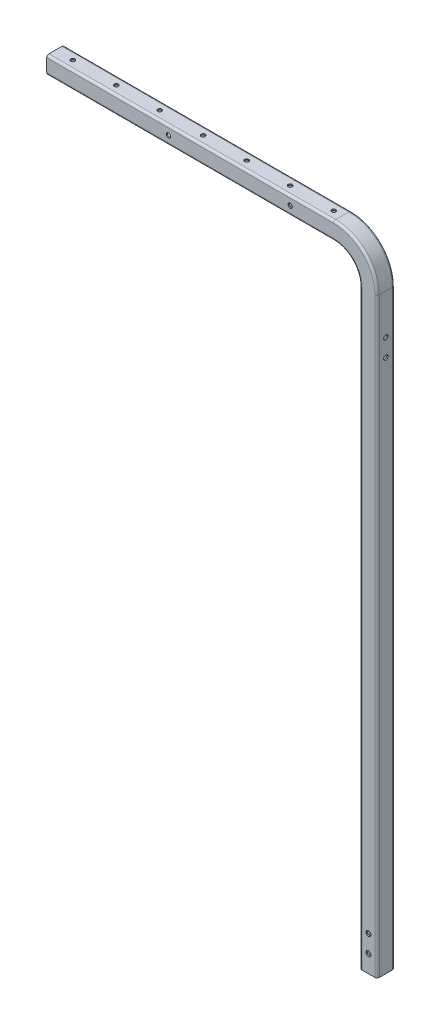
from build123d import *

# Parameters (mm, degrees)
SKETCH2_W                   = 25.4
SKETCH2_H                   = 25.4
FILLET1_R                   = 3.175
SHELL1_T                    = -1.5875
F_6_0_6_DIAMETER_HOLE1_D    = 6
LPATTERN3_COUNT             = 7
LPATTERN3_PITCH             = 63.5
SKETCH5_R                   = 3.175
CONT_MTG_DEPTH              = 1035.017122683
F_1_4_0_25_DIAMETER_HOLE1_D = 6.35
SKETCH8_R                   = 3.571875
CUT_EXTRUDE1_DEPTH          = 1035.251072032
LPATTERN2_COUNT             = 2
LPATTERN2_PITCH             = 25.4


with BuildPart() as part:
    # Base-Sweep: sweep along a path in Sketch1
    with BuildLine(Plane.XY) as base_sweep_path:
        Line((0, 0), (419.1, 0))
        ThreePointArc((419.1, 0), (455.021024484, -14.878975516), (469.9, -50.8))
        Line((469.9, -50.8), (469.9, -914.4))
    # Sketch2 (on Right Plane) → Base-Sweep (sweep)
    with BuildSketch(Plane(origin=(0, 0, 0), x_dir=(0, 0, -1), z_dir=(1, 0, 0))):
        Rectangle(SKETCH2_W, SKETCH2_H)
    sweep(path=base_sweep_path.line)

    # Fillet1
    fillet1_edges = [part.edges().sort_by_distance(p)[0] for p in [
        (464.001280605, -5.898719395, 12.7),
        (464.001280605, -5.898719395, -12.7),
        (446.040768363, -23.859231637, -12.7),
        (446.040768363, -23.859231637, 12.7),
        (482.6, -482.6, 12.7),
        (482.6, -482.6, -12.7),
        (457.2, -482.6, -12.7),
        (457.2, -482.6, 12.7),
        (209.55, 12.7, 12.7),
        (209.55, 12.7, -12.7),
        (209.55, -12.7, -12.7),
        (209.55, -12.7, 12.7),
    ]]
    fillet(fillet1_edges, radius=FILLET1_R)

    # Shell1
    shell1_openings = [part.faces().sort_by_distance(p)[0] for p in [
        (469.9, -914.4, 0),
        (0, 0, 0),
    ]]
    offset(amount=SHELL1_T, openings=shell1_openings, kind=Kind.INTERSECTION)

    # 6.0 _6_ Diameter Hole1 (through all)
    with Locations(Plane(origin=(0, 12.7, 0), x_dir=(1, 0, 0), z_dir=(0, 1, 0))):
        with Locations((406.4, 0)):
            f_6_0_6_diameter_hole1 = Hole(F_6_0_6_DIAMETER_HOLE1_D / 2)

    # LPattern3: 6.0 _6_ Diameter Hole1 ×7
    with Locations(*[(-i * LPATTERN3_PITCH, 0, 0) for i in range(1, LPATTERN3_COUNT)]):
        add(f_6_0_6_diameter_hole1, mode=Mode.SUBTRACT)

    # Sketch5 → cont_mtg (cut, through all)
    with BuildSketch(Plane(origin=(482.6, 0, 0), x_dir=(0, 0, -1), z_dir=(1, 0, 0))):
        with Locations(Location((0, -109.5375, 0), (0, 0, 90))):
            Circle(SKETCH5_R)
        with Locations(Location((0, -134.9375, 0), (0, 0, 90))):
            Circle(SKETCH5_R)
    extrude(amount=-CONT_MTG_DEPTH, mode=Mode.SUBTRACT)

    # 1_4 _0.25_ Diameter Hole1 (through all)
    with Locations(Plane.XY.offset(12.7)):
        with Locations((177.8, 0), (355.6, 0)):
            Hole(F_1_4_0_25_DIAMETER_HOLE1_D / 2)

    # Sketch8 → Cut-Extrude1 (cut, through all)
    with BuildSketch(Plane(origin=(0, 0, -12.7), x_dir=(-1, 0, 0), z_dir=(0, 0, -1))):
        with Locations(Location((-469.9, -889, 0), (0, 0, 90))):
            Circle(SKETCH8_R)
    cut_extrude1 = extrude(amount=-CUT_EXTRUDE1_DEPTH, mode=Mode.SUBTRACT)

    # LPattern2: Cut-Extrude1 ×2
    with Locations(*[(0, i * LPATTERN2_PITCH, 0) for i in range(1, LPATTERN2_COUNT)]):
        add(cut_extrude1, mode=Mode.SUBTRACT)


solid = part.part
